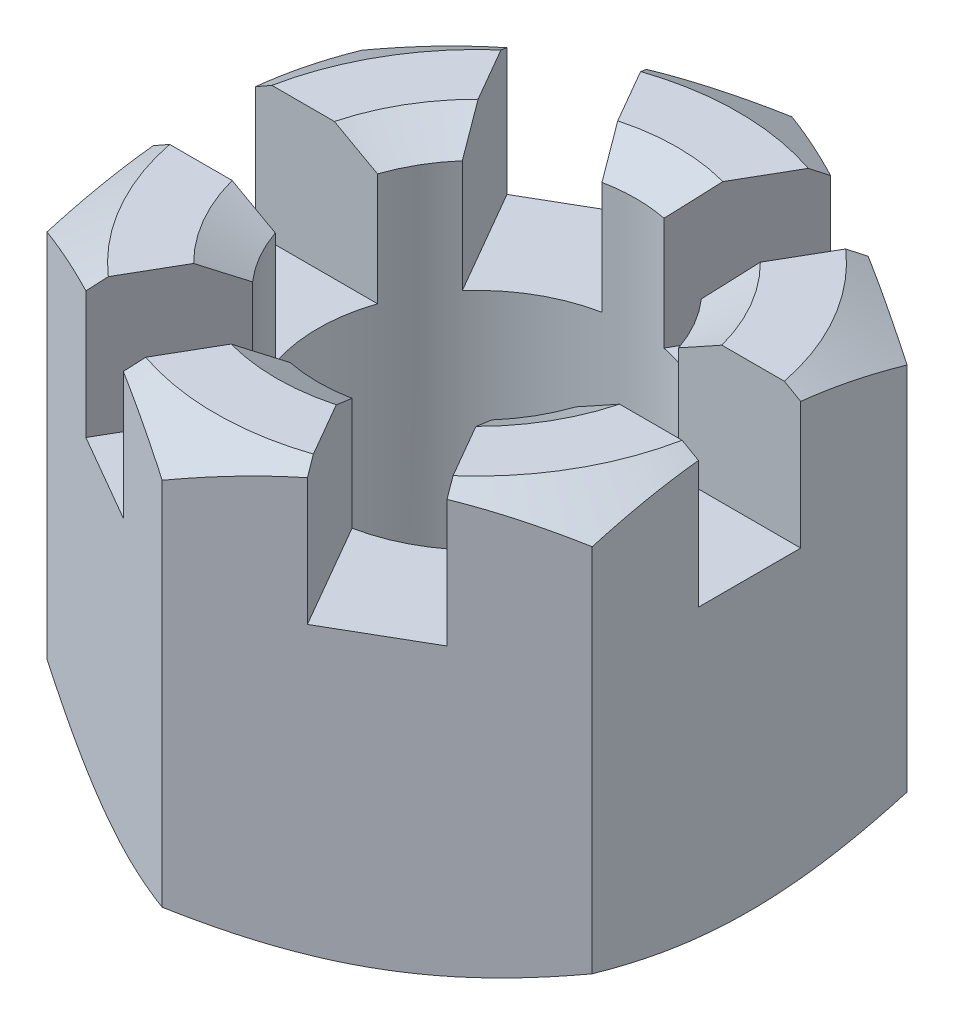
from build123d import *

# Parameters (mm, degrees)
BASENUT_DEPTH    = 19
HOLESKE_R        = 7
TAPPEDHOLE_DEPTH = 27.400757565
CHAMFER1_SIZE    = 1.05
CHAMFER1_SIZE2   = 1.818653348
SLOTSKE_W        = 4.5
SLOTSKE_H        = 19
SLOT_DEPTH       = 28.8
SLOTPAT_COUNT    = 6


with BuildPart() as part:
    # BaseNutSke → BaseNut (new body)
    with BuildSketch(Plane(origin=(0, 0, 0), x_dir=(1, 0, 0), z_dir=(0, 1, 0))):
        Polygon((0, 13.856406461), (-12, 6.92820323), (-12, -6.92820323), (0, -13.856406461), (12, -6.92820323), (12, 6.92820323), align=None)
    extrude(amount=BASENUT_DEPTH)

    # CutNutSke → CutNut (revolve, cut)
    with BuildSketch(Plane(origin=(0, 0, 0), x_dir=(0, 0, -1), z_dir=(1, 0, 0)), mode=Mode.PRIVATE) as cutnut_sk:
        Polygon((-13.856406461, 19), (-11.5, 19), (-13.856406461, 17.639528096), align=None)
    cutnut = revolve(cutnut_sk.sketch.rotate(Axis((0, 0, 0), (0, 1, 0)), 180), axis=Axis((0, 0, 0), (0, 1, 0)), mode=Mode.SUBTRACT)

    # MirrorChamfer: CutNut across plane
    add(cutnut.mirror(Plane.ZX.offset(9.5)), mode=Mode.SUBTRACT)

    # HoleSke → TappedHole (cut, through all)
    with BuildSketch(Plane(origin=(0, 0, 0), x_dir=(1, 0, 0), z_dir=(0, 1, 0))):
        with Locations(Location((0, 0, 0), (0, 0, 270))):
            Circle(HOLESKE_R)
    extrude(amount=TAPPEDHOLE_DEPTH, mode=Mode.SUBTRACT)

    # Chamfer1
    chamfer1_edges = [part.edges().sort_by_distance(p)[0] for p in [
        (0, 0, -7),
        (0, 19, -7),
    ]]
    chamfer1_side = [part.faces().sort_by_distance(p)[0] for p in [
        (0, 9.5, -7),
    ]]
    chamfer(chamfer1_edges, length=CHAMFER1_SIZE, length2=CHAMFER1_SIZE2, reference=chamfer1_side[0])

    # SlotSke → Slot (cut)
    with BuildSketch(Plane(origin=(0, 0, 0), x_dir=(0, 0, -1), z_dir=(1, 0, 0))):
        with Locations((0, 22.5)):
            Rectangle(SLOTSKE_W, SLOTSKE_H)
    slot = extrude(amount=-SLOT_DEPTH, mode=Mode.SUBTRACT)

    # SlotPat: Slot ×6 about axis
    slotpat_axis = Axis((0, 0, 0), (0, 1, 0))
    for i in range(1, SLOTPAT_COUNT):
        add(slot.rotate(slotpat_axis, i * 360 / SLOTPAT_COUNT), mode=Mode.SUBTRACT)


solid = part.part
